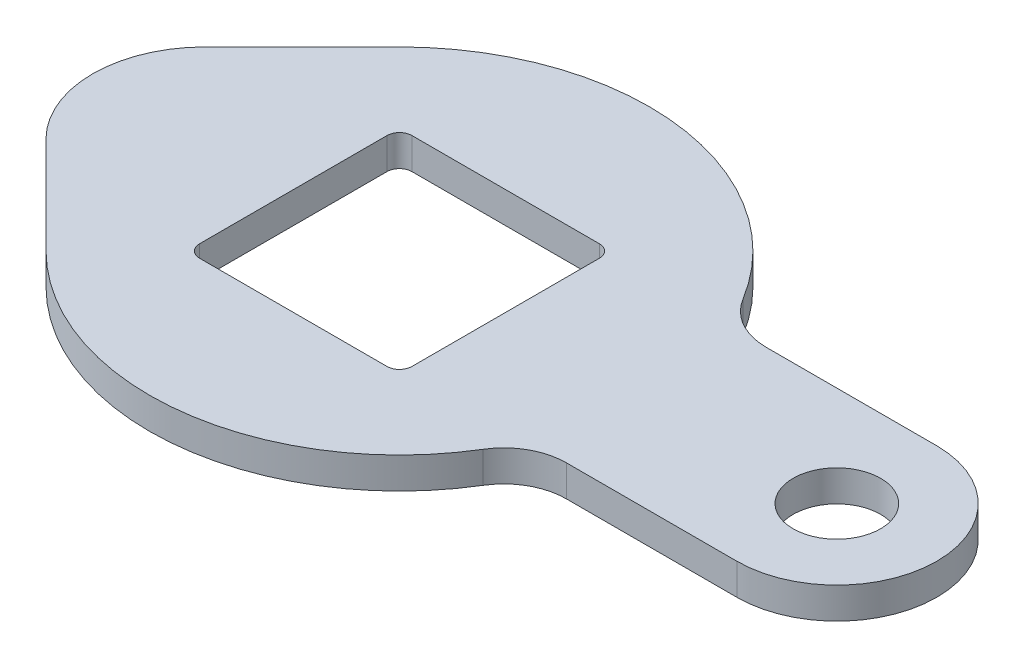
ISO-10303-21;
HEADER;
FILE_DESCRIPTION(('STEP AP214'),'2;1');
FILE_NAME('part.step','',(''),(''),'','','');
FILE_SCHEMA(('AUTOMOTIVE_DESIGN { 1 0 10303 214 1 1 1 1 }'));
ENDSEC;
DATA;
#1=APPLICATION_CONTEXT('core data for automotive mechanical design processes');
#2=APPLICATION_PROTOCOL_DEFINITION('international standard','automotive_design',2000,#1);
#3=PRODUCT_CONTEXT('',#1,'mechanical');
#4=PRODUCT('Part','Part','',(#3));
#5=PRODUCT_RELATED_PRODUCT_CATEGORY('part','',(#4));
#6=PRODUCT_DEFINITION_FORMATION('','',#4);
#7=PRODUCT_DEFINITION_CONTEXT('part definition',#1,'design');
#8=PRODUCT_DEFINITION('design','',#6,#7);
#9=PRODUCT_DEFINITION_SHAPE('','',#8);
#10=(LENGTH_UNIT() NAMED_UNIT(*) SI_UNIT(.MILLI.,.METRE.));
#11=(NAMED_UNIT(*) PLANE_ANGLE_UNIT() SI_UNIT($,.RADIAN.));
#12=(NAMED_UNIT(*) SI_UNIT($,.STERADIAN.) SOLID_ANGLE_UNIT());
#13=UNCERTAINTY_MEASURE_WITH_UNIT(LENGTH_MEASURE(1.E-05),#10,'distance_accuracy_value','');
#14=(GEOMETRIC_REPRESENTATION_CONTEXT(3) GLOBAL_UNCERTAINTY_ASSIGNED_CONTEXT((#13)) GLOBAL_UNIT_ASSIGNED_CONTEXT((#10,
#11,#12)) REPRESENTATION_CONTEXT('',''));
#15=CARTESIAN_POINT('',(0.,0.,0.));
#16=DIRECTION('',(0.,0.,1.));
#17=DIRECTION('',(1.,0.,0.));
#18=AXIS2_PLACEMENT_3D('',#15,#16,#17);
#19=CARTESIAN_POINT('',(21.3541565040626,-2.5,-13.));
#20=DIRECTION('',(0.,1.,0.));
#21=DIRECTION('',(0.,0.,1.));
#22=AXIS2_PLACEMENT_3D('',#19,#20,#21);
#23=CYLINDRICAL_SURFACE('',#22,5.);
#24=CARTESIAN_POINT('',(21.3541565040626,0.,-13.));
#25=DIRECTION('',(0.,-1.,0.));
#26=DIRECTION('',(0.,0.,-1.));
#27=AXIS2_PLACEMENT_3D('',#24,#25,#26);
#28=CIRCLE('',#27,5.);
#29=CARTESIAN_POINT('',(21.3541565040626,0.,-8.));
#30=VERTEX_POINT('',#29);
#31=CARTESIAN_POINT('',(17.0833252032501,0.,-10.4));
#32=VERTEX_POINT('',#31);
#33=EDGE_CURVE('E219',#30,#32,#28,.T.);
#34=ORIENTED_EDGE('',*,*,#33,.F.);
#35=DIRECTION('',(0.,1.,0.));
#36=VECTOR('',#35,1.);
#37=CARTESIAN_POINT('',(21.3541565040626,-2.5,-8.));
#38=LINE('',#37,#36);
#39=CARTESIAN_POINT('',(21.3541565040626,-2.5,-8.));
#40=VERTEX_POINT('',#39);
#41=EDGE_CURVE('E11',#40,#30,#38,.T.);
#42=ORIENTED_EDGE('',*,*,#41,.F.);
#43=CARTESIAN_POINT('',(21.3541565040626,-2.5,-13.));
#44=DIRECTION('',(0.,-1.,0.));
#45=DIRECTION('',(0.,0.,-1.));
#46=AXIS2_PLACEMENT_3D('',#43,#44,#45);
#47=CIRCLE('',#46,5.);
#48=CARTESIAN_POINT('',(17.0833252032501,-2.5,-10.4));
#49=VERTEX_POINT('',#48);
#50=EDGE_CURVE('E231',#40,#49,#47,.T.);
#51=ORIENTED_EDGE('',*,*,#50,.T.);
#52=DIRECTION('',(0.,1.,0.));
#53=VECTOR('',#52,1.);
#54=CARTESIAN_POINT('',(17.0833252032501,-2.5,-10.4));
#55=LINE('',#54,#53);
#56=EDGE_CURVE('E36',#49,#32,#55,.T.);
#57=ORIENTED_EDGE('',*,*,#56,.T.);
#58=EDGE_LOOP('',(#34,#42,#51,#57));
#59=FACE_BOUND('',#58,.T.);
#60=ADVANCED_FACE('F33',(#59),#23,.F.);
#61=CARTESIAN_POINT('',(35.,-2.5,-8.));
#62=DIRECTION('',(0.,0.,-1.));
#63=DIRECTION('',(-1.,0.,0.));
#64=AXIS2_PLACEMENT_3D('',#61,#62,#63);
#65=PLANE('',#64);
#66=DIRECTION('',(-1.,0.,0.));
#67=VECTOR('',#66,1.);
#68=CARTESIAN_POINT('',(35.,0.,-8.));
#69=LINE('',#68,#67);
#70=CARTESIAN_POINT('',(35.,0.,-8.));
#71=VERTEX_POINT('',#70);
#72=EDGE_CURVE('E235',#71,#30,#69,.T.);
#73=ORIENTED_EDGE('',*,*,#72,.F.);
#74=DIRECTION('',(0.,1.,0.));
#75=VECTOR('',#74,1.);
#76=CARTESIAN_POINT('',(35.,-2.5,-8.));
#77=LINE('',#76,#75);
#78=CARTESIAN_POINT('',(35.,-2.5,-8.));
#79=VERTEX_POINT('',#78);
#80=EDGE_CURVE('E41',#79,#71,#77,.T.);
#81=ORIENTED_EDGE('',*,*,#80,.F.);
#82=DIRECTION('',(-1.,0.,0.));
#83=VECTOR('',#82,1.);
#84=CARTESIAN_POINT('',(35.,-2.5,-8.));
#85=LINE('',#84,#83);
#86=EDGE_CURVE('E259',#79,#40,#85,.T.);
#87=ORIENTED_EDGE('',*,*,#86,.T.);
#88=ORIENTED_EDGE('',*,*,#41,.T.);
#89=EDGE_LOOP('',(#73,#81,#87,#88));
#90=FACE_BOUND('',#89,.T.);
#91=ADVANCED_FACE('F316',(#90),#65,.T.);
#92=CARTESIAN_POINT('',(35.,-2.5,0.));
#93=DIRECTION('',(0.,1.,0.));
#94=DIRECTION('',(0.,0.,1.));
#95=AXIS2_PLACEMENT_3D('',#92,#93,#94);
#96=CYLINDRICAL_SURFACE('',#95,8.);
#97=CARTESIAN_POINT('',(35.,0.,0.));
#98=DIRECTION('',(0.,1.,0.));
#99=DIRECTION('',(0.,0.,1.));
#100=AXIS2_PLACEMENT_3D('',#97,#98,#99);
#101=CIRCLE('',#100,8.);
#102=CARTESIAN_POINT('',(35.,0.,8.));
#103=VERTEX_POINT('',#102);
#104=EDGE_CURVE('E285',#103,#71,#101,.T.);
#105=ORIENTED_EDGE('',*,*,#104,.F.);
#106=DIRECTION('',(0.,1.,0.));
#107=VECTOR('',#106,1.);
#108=CARTESIAN_POINT('',(35.,-2.5,8.));
#109=LINE('',#108,#107);
#110=CARTESIAN_POINT('',(35.,-2.5,8.));
#111=VERTEX_POINT('',#110);
#112=EDGE_CURVE('E291',#111,#103,#109,.T.);
#113=ORIENTED_EDGE('',*,*,#112,.F.);
#114=CARTESIAN_POINT('',(35.,-2.5,0.));
#115=DIRECTION('',(0.,1.,0.));
#116=DIRECTION('',(0.,0.,1.));
#117=AXIS2_PLACEMENT_3D('',#114,#115,#116);
#118=CIRCLE('',#117,8.);
#119=EDGE_CURVE('E256',#111,#79,#118,.T.);
#120=ORIENTED_EDGE('',*,*,#119,.T.);
#121=ORIENTED_EDGE('',*,*,#80,.T.);
#122=EDGE_LOOP('',(#105,#113,#120,#121));
#123=FACE_BOUND('',#122,.T.);
#124=ADVANCED_FACE('F343',(#123),#96,.T.);
#125=CARTESIAN_POINT('',(35.,-2.5,8.));
#126=DIRECTION('',(0.,0.,1.));
#127=DIRECTION('',(1.,0.,0.));
#128=AXIS2_PLACEMENT_3D('',#125,#126,#127);
#129=PLANE('',#128);
#130=DIRECTION('',(1.,0.,0.));
#131=VECTOR('',#130,1.);
#132=CARTESIAN_POINT('',(35.,0.,8.));
#133=LINE('',#132,#131);
#134=CARTESIAN_POINT('',(21.3541565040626,0.,8.));
#135=VERTEX_POINT('',#134);
#136=EDGE_CURVE('E282',#135,#103,#133,.T.);
#137=ORIENTED_EDGE('',*,*,#136,.F.);
#138=DIRECTION('',(0.,1.,0.));
#139=VECTOR('',#138,1.);
#140=CARTESIAN_POINT('',(21.3541565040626,-2.5,8.));
#141=LINE('',#140,#139);
#142=CARTESIAN_POINT('',(21.3541565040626,-2.5,8.));
#143=VERTEX_POINT('',#142);
#144=EDGE_CURVE('E293',#143,#135,#141,.T.);
#145=ORIENTED_EDGE('',*,*,#144,.F.);
#146=DIRECTION('',(1.,0.,0.));
#147=VECTOR('',#146,1.);
#148=CARTESIAN_POINT('',(35.,-2.5,8.));
#149=LINE('',#148,#147);
#150=EDGE_CURVE('E253',#143,#111,#149,.T.);
#151=ORIENTED_EDGE('',*,*,#150,.T.);
#152=ORIENTED_EDGE('',*,*,#112,.T.);
#153=EDGE_LOOP('',(#137,#145,#151,#152));
#154=FACE_BOUND('',#153,.T.);
#155=ADVANCED_FACE('F341',(#154),#129,.T.);
#156=CARTESIAN_POINT('',(21.3541565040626,-2.5,13.));
#157=DIRECTION('',(0.,1.,0.));
#158=DIRECTION('',(0.,0.,1.));
#159=AXIS2_PLACEMENT_3D('',#156,#157,#158);
#160=CYLINDRICAL_SURFACE('',#159,5.);
#161=CARTESIAN_POINT('',(21.3541565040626,0.,13.));
#162=DIRECTION('',(0.,-1.,0.));
#163=DIRECTION('',(0.,0.,-1.));
#164=AXIS2_PLACEMENT_3D('',#161,#162,#163);
#165=CIRCLE('',#164,5.);
#166=CARTESIAN_POINT('',(17.0833252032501,0.,10.4));
#167=VERTEX_POINT('',#166);
#168=EDGE_CURVE('E279',#167,#135,#165,.T.);
#169=ORIENTED_EDGE('',*,*,#168,.F.);
#170=DIRECTION('',(0.,1.,0.));
#171=VECTOR('',#170,1.);
#172=CARTESIAN_POINT('',(17.0833252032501,-2.5,10.4));
#173=LINE('',#172,#171);
#174=CARTESIAN_POINT('',(17.0833252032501,-2.5,10.4));
#175=VERTEX_POINT('',#174);
#176=EDGE_CURVE('E295',#175,#167,#173,.T.);
#177=ORIENTED_EDGE('',*,*,#176,.F.);
#178=CARTESIAN_POINT('',(21.3541565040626,-2.5,13.));
#179=DIRECTION('',(0.,-1.,0.));
#180=DIRECTION('',(0.,0.,-1.));
#181=AXIS2_PLACEMENT_3D('',#178,#179,#180);
#182=CIRCLE('',#181,5.);
#183=EDGE_CURVE('E250',#175,#143,#182,.T.);
#184=ORIENTED_EDGE('',*,*,#183,.T.);
#185=ORIENTED_EDGE('',*,*,#144,.T.);
#186=EDGE_LOOP('',(#169,#177,#184,#185));
#187=FACE_BOUND('',#186,.T.);
#188=ADVANCED_FACE('F337',(#187),#160,.F.);
#189=CARTESIAN_POINT('',(0.,-2.5,0.));
#190=DIRECTION('',(0.,1.,0.));
#191=DIRECTION('',(0.,0.,1.));
#192=AXIS2_PLACEMENT_3D('',#189,#190,#191);
#193=CYLINDRICAL_SURFACE('',#192,20.);
#194=CARTESIAN_POINT('',(0.,0.,0.));
#195=DIRECTION('',(0.,1.,0.));
#196=DIRECTION('',(0.,0.,1.));
#197=AXIS2_PLACEMENT_3D('',#194,#195,#196);
#198=CIRCLE('',#197,20.);
#199=CARTESIAN_POINT('',(-14.142135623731,0.,14.1421356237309));
#200=VERTEX_POINT('',#199);
#201=EDGE_CURVE('E276',#200,#167,#198,.T.);
#202=ORIENTED_EDGE('',*,*,#201,.F.);
#203=DIRECTION('',(0.,1.,0.));
#204=VECTOR('',#203,1.);
#205=CARTESIAN_POINT('',(-14.142135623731,-2.5,14.1421356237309));
#206=LINE('',#205,#204);
#207=CARTESIAN_POINT('',(-14.142135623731,-2.5,14.1421356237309));
#208=VERTEX_POINT('',#207);
#209=EDGE_CURVE('E297',#208,#200,#206,.T.);
#210=ORIENTED_EDGE('',*,*,#209,.F.);
#211=CARTESIAN_POINT('',(0.,-2.5,0.));
#212=DIRECTION('',(0.,1.,0.));
#213=DIRECTION('',(0.,0.,1.));
#214=AXIS2_PLACEMENT_3D('',#211,#212,#213);
#215=CIRCLE('',#214,20.);
#216=EDGE_CURVE('E247',#208,#175,#215,.T.);
#217=ORIENTED_EDGE('',*,*,#216,.T.);
#218=ORIENTED_EDGE('',*,*,#176,.T.);
#219=EDGE_LOOP('',(#202,#210,#217,#218));
#220=FACE_BOUND('',#219,.T.);
#221=ADVANCED_FACE('F333',(#220),#193,.T.);
#222=CARTESIAN_POINT('',(-21.920310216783,-2.5,6.36396103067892));
#223=DIRECTION('',(-0.707106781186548,0.,0.707106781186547));
#224=DIRECTION('',(0.707106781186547,0.,0.707106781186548));
#225=AXIS2_PLACEMENT_3D('',#222,#223,#224);
#226=PLANE('',#225);
#227=DIRECTION('',(0.707106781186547,0.,0.707106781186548));
#228=VECTOR('',#227,1.);
#229=CARTESIAN_POINT('',(-21.920310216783,0.,6.36396103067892));
#230=LINE('',#229,#228);
#231=CARTESIAN_POINT('',(-21.920310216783,0.,6.36396103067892));
#232=VERTEX_POINT('',#231);
#233=EDGE_CURVE('E273',#232,#200,#230,.T.);
#234=ORIENTED_EDGE('',*,*,#233,.F.);
#235=DIRECTION('',(0.,1.,0.));
#236=VECTOR('',#235,1.);
#237=CARTESIAN_POINT('',(-21.920310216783,-2.5,6.36396103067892));
#238=LINE('',#237,#236);
#239=CARTESIAN_POINT('',(-21.920310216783,-2.5,6.36396103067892));
#240=VERTEX_POINT('',#239);
#241=EDGE_CURVE('E299',#240,#232,#238,.T.);
#242=ORIENTED_EDGE('',*,*,#241,.F.);
#243=DIRECTION('',(0.707106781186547,0.,0.707106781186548));
#244=VECTOR('',#243,1.);
#245=CARTESIAN_POINT('',(-21.920310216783,-2.5,6.36396103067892));
#246=LINE('',#245,#244);
#247=EDGE_CURVE('E244',#240,#208,#246,.T.);
#248=ORIENTED_EDGE('',*,*,#247,.T.);
#249=ORIENTED_EDGE('',*,*,#209,.T.);
#250=EDGE_LOOP('',(#234,#242,#248,#249));
#251=FACE_BOUND('',#250,.T.);
#252=ADVANCED_FACE('F329',(#251),#226,.T.);
#253=CARTESIAN_POINT('',(-15.556349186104,-2.5,0.));
#254=DIRECTION('',(0.,1.,0.));
#255=DIRECTION('',(0.,0.,1.));
#256=AXIS2_PLACEMENT_3D('',#253,#254,#255);
#257=CYLINDRICAL_SURFACE('',#256,8.99999999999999);
#258=CARTESIAN_POINT('',(-15.556349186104,0.,0.));
#259=DIRECTION('',(0.,1.,0.));
#260=DIRECTION('',(0.,0.,-1.));
#261=AXIS2_PLACEMENT_3D('',#258,#259,#260);
#262=CIRCLE('',#261,8.99999999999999);
#263=CARTESIAN_POINT('',(-21.920310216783,0.,-6.36396103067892));
#264=VERTEX_POINT('',#263);
#265=EDGE_CURVE('E270',#264,#232,#262,.T.);
#266=ORIENTED_EDGE('',*,*,#265,.F.);
#267=DIRECTION('',(0.,1.,0.));
#268=VECTOR('',#267,1.);
#269=CARTESIAN_POINT('',(-21.920310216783,-2.5,-6.36396103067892));
#270=LINE('',#269,#268);
#271=CARTESIAN_POINT('',(-21.920310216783,-2.5,-6.36396103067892));
#272=VERTEX_POINT('',#271);
#273=EDGE_CURVE('E301',#272,#264,#270,.T.);
#274=ORIENTED_EDGE('',*,*,#273,.F.);
#275=CARTESIAN_POINT('',(-15.556349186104,-2.5,0.));
#276=DIRECTION('',(0.,1.,0.));
#277=DIRECTION('',(0.,0.,-1.));
#278=AXIS2_PLACEMENT_3D('',#275,#276,#277);
#279=CIRCLE('',#278,8.99999999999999);
#280=EDGE_CURVE('E241',#272,#240,#279,.T.);
#281=ORIENTED_EDGE('',*,*,#280,.T.);
#282=ORIENTED_EDGE('',*,*,#241,.T.);
#283=EDGE_LOOP('',(#266,#274,#281,#282));
#284=FACE_BOUND('',#283,.T.);
#285=ADVANCED_FACE('F327',(#284),#257,.T.);
#286=CARTESIAN_POINT('',(-14.1421356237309,-2.5,-14.1421356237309));
#287=DIRECTION('',(-0.707106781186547,0.,-0.707106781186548));
#288=DIRECTION('',(-0.707106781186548,0.,0.707106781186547));
#289=AXIS2_PLACEMENT_3D('',#286,#287,#288);
#290=PLANE('',#289);
#291=DIRECTION('',(-0.707106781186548,0.,0.707106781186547));
#292=VECTOR('',#291,1.);
#293=CARTESIAN_POINT('',(-14.1421356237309,0.,-14.1421356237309));
#294=LINE('',#293,#292);
#295=CARTESIAN_POINT('',(-14.1421356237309,0.,-14.1421356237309));
#296=VERTEX_POINT('',#295);
#297=EDGE_CURVE('E267',#296,#264,#294,.T.);
#298=ORIENTED_EDGE('',*,*,#297,.F.);
#299=DIRECTION('',(0.,1.,0.));
#300=VECTOR('',#299,1.);
#301=CARTESIAN_POINT('',(-14.1421356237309,-2.5,-14.1421356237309));
#302=LINE('',#301,#300);
#303=CARTESIAN_POINT('',(-14.1421356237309,-2.5,-14.1421356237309));
#304=VERTEX_POINT('',#303);
#305=EDGE_CURVE('E302',#304,#296,#302,.T.);
#306=ORIENTED_EDGE('',*,*,#305,.F.);
#307=DIRECTION('',(-0.707106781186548,0.,0.707106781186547));
#308=VECTOR('',#307,1.);
#309=CARTESIAN_POINT('',(-14.1421356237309,-2.5,-14.1421356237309));
#310=LINE('',#309,#308);
#311=EDGE_CURVE('E238',#304,#272,#310,.T.);
#312=ORIENTED_EDGE('',*,*,#311,.T.);
#313=ORIENTED_EDGE('',*,*,#273,.T.);
#314=EDGE_LOOP('',(#298,#306,#312,#313));
#315=FACE_BOUND('',#314,.T.);
#316=ADVANCED_FACE('F323',(#315),#290,.T.);
#317=CARTESIAN_POINT('',(0.,-2.5,0.));
#318=DIRECTION('',(0.,1.,0.));
#319=DIRECTION('',(0.,0.,1.));
#320=AXIS2_PLACEMENT_3D('',#317,#318,#319);
#321=CYLINDRICAL_SURFACE('',#320,20.);
#322=CARTESIAN_POINT('',(0.,0.,0.));
#323=DIRECTION('',(0.,1.,0.));
#324=DIRECTION('',(0.,0.,1.));
#325=AXIS2_PLACEMENT_3D('',#322,#323,#324);
#326=CIRCLE('',#325,20.);
#327=EDGE_CURVE('E264',#32,#296,#326,.T.);
#328=ORIENTED_EDGE('',*,*,#327,.F.);
#329=ORIENTED_EDGE('',*,*,#56,.F.);
#330=CARTESIAN_POINT('',(0.,-2.5,0.));
#331=DIRECTION('',(0.,1.,0.));
#332=DIRECTION('',(0.,0.,1.));
#333=AXIS2_PLACEMENT_3D('',#330,#331,#332);
#334=CIRCLE('',#333,20.);
#335=EDGE_CURVE('E234',#49,#304,#334,.T.);
#336=ORIENTED_EDGE('',*,*,#335,.T.);
#337=ORIENTED_EDGE('',*,*,#305,.T.);
#338=EDGE_LOOP('',(#328,#329,#336,#337));
#339=FACE_BOUND('',#338,.T.);
#340=ADVANCED_FACE('F310',(#339),#321,.T.);
#341=CARTESIAN_POINT('',(21.3541565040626,-2.5,-13.));
#342=DIRECTION('',(0.,-1.,0.));
#343=DIRECTION('',(0.,0.,-1.));
#344=AXIS2_PLACEMENT_3D('',#341,#342,#343);
#345=PLANE('',#344);
#346=CARTESIAN_POINT('',(35.,-2.5,0.));
#347=DIRECTION('',(0.,1.,0.));
#348=DIRECTION('',(0.,0.,1.));
#349=AXIS2_PLACEMENT_3D('',#346,#347,#348);
#350=CIRCLE('',#349,3.5);
#351=CARTESIAN_POINT('',(35.,-2.5,3.5));
#352=VERTEX_POINT('',#351);
#353=EDGE_CURVE('E201',#352,#352,#350,.T.);
#354=ORIENTED_EDGE('',*,*,#353,.T.);
#355=EDGE_LOOP('',(#354));
#356=FACE_BOUND('',#355,.T.);
#357=CARTESIAN_POINT('',(-7.5,-2.5,-7.5));
#358=DIRECTION('',(0.,1.,0.));
#359=DIRECTION('',(0.,0.,1.));
#360=AXIS2_PLACEMENT_3D('',#357,#358,#359);
#361=CIRCLE('',#360,0.999999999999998);
#362=CARTESIAN_POINT('',(-7.5,-2.5,-8.5));
#363=VERTEX_POINT('',#362);
#364=CARTESIAN_POINT('',(-8.5,-2.5,-7.5));
#365=VERTEX_POINT('',#364);
#366=EDGE_CURVE('E160',#363,#365,#361,.T.);
#367=ORIENTED_EDGE('',*,*,#366,.T.);
#368=DIRECTION('',(0.,0.,1.));
#369=VECTOR('',#368,1.);
#370=CARTESIAN_POINT('',(-8.5,-2.5,-7.5));
#371=LINE('',#370,#369);
#372=CARTESIAN_POINT('',(-8.5,-2.5,7.5));
#373=VERTEX_POINT('',#372);
#374=EDGE_CURVE('E169',#365,#373,#371,.T.);
#375=ORIENTED_EDGE('',*,*,#374,.T.);
#376=CARTESIAN_POINT('',(-7.5,-2.5,7.5));
#377=DIRECTION('',(0.,1.,0.));
#378=DIRECTION('',(0.,0.,1.));
#379=AXIS2_PLACEMENT_3D('',#376,#377,#378);
#380=CIRCLE('',#379,0.999999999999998);
#381=CARTESIAN_POINT('',(-7.5,-2.5,8.5));
#382=VERTEX_POINT('',#381);
#383=EDGE_CURVE('E49',#373,#382,#380,.T.);
#384=ORIENTED_EDGE('',*,*,#383,.T.);
#385=DIRECTION('',(1.,0.,0.));
#386=VECTOR('',#385,1.);
#387=CARTESIAN_POINT('',(-7.5,-2.5,8.5));
#388=LINE('',#387,#386);
#389=CARTESIAN_POINT('',(7.50000000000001,-2.5,8.49999999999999));
#390=VERTEX_POINT('',#389);
#391=EDGE_CURVE('E187',#382,#390,#388,.T.);
#392=ORIENTED_EDGE('',*,*,#391,.T.);
#393=CARTESIAN_POINT('',(7.50000000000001,-2.5,7.5));
#394=DIRECTION('',(0.,1.,0.));
#395=DIRECTION('',(0.,0.,1.));
#396=AXIS2_PLACEMENT_3D('',#393,#394,#395);
#397=CIRCLE('',#396,0.999999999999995);
#398=CARTESIAN_POINT('',(8.5,-2.5,7.5));
#399=VERTEX_POINT('',#398);
#400=EDGE_CURVE('E190',#390,#399,#397,.T.);
#401=ORIENTED_EDGE('',*,*,#400,.T.);
#402=DIRECTION('',(0.,0.,-1.));
#403=VECTOR('',#402,1.);
#404=CARTESIAN_POINT('',(8.5,-2.5,-7.49999999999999));
#405=LINE('',#404,#403);
#406=CARTESIAN_POINT('',(8.5,-2.5,-7.49999999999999));
#407=VERTEX_POINT('',#406);
#408=EDGE_CURVE('E193',#399,#407,#405,.T.);
#409=ORIENTED_EDGE('',*,*,#408,.T.);
#410=CARTESIAN_POINT('',(7.5,-2.5,-7.5));
#411=DIRECTION('',(0.,1.,0.));
#412=DIRECTION('',(0.,0.,-1.));
#413=AXIS2_PLACEMENT_3D('',#410,#411,#412);
#414=CIRCLE('',#413,1.);
#415=CARTESIAN_POINT('',(7.49999999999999,-2.5,-8.5));
#416=VERTEX_POINT('',#415);
#417=EDGE_CURVE('E196',#407,#416,#414,.T.);
#418=ORIENTED_EDGE('',*,*,#417,.T.);
#419=DIRECTION('',(-1.,0.,0.));
#420=VECTOR('',#419,1.);
#421=CARTESIAN_POINT('',(-7.5,-2.5,-8.5));
#422=LINE('',#421,#420);
#423=EDGE_CURVE('E166',#416,#363,#422,.T.);
#424=ORIENTED_EDGE('',*,*,#423,.T.);
#425=EDGE_LOOP('',(#367,#375,#384,#392,#401,#409,#418,#424));
#426=FACE_BOUND('',#425,.T.);
#427=ORIENTED_EDGE('',*,*,#50,.F.);
#428=ORIENTED_EDGE('',*,*,#86,.F.);
#429=ORIENTED_EDGE('',*,*,#119,.F.);
#430=ORIENTED_EDGE('',*,*,#150,.F.);
#431=ORIENTED_EDGE('',*,*,#183,.F.);
#432=ORIENTED_EDGE('',*,*,#216,.F.);
#433=ORIENTED_EDGE('',*,*,#247,.F.);
#434=ORIENTED_EDGE('',*,*,#280,.F.);
#435=ORIENTED_EDGE('',*,*,#311,.F.);
#436=ORIENTED_EDGE('',*,*,#335,.F.);
#437=EDGE_LOOP('',(#427,#428,#429,#430,#431,#432,#433,#434,#435,#436));
#438=FACE_BOUND('',#437,.T.);
#439=ADVANCED_FACE('F173',(#356,#426,#438),#345,.T.);
#440=CARTESIAN_POINT('',(21.3541565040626,0.,-13.));
#441=DIRECTION('',(0.,-1.,0.));
#442=DIRECTION('',(0.,0.,-1.));
#443=AXIS2_PLACEMENT_3D('',#440,#441,#442);
#444=PLANE('',#443);
#445=CARTESIAN_POINT('',(35.,0.,0.));
#446=DIRECTION('',(0.,1.,0.));
#447=DIRECTION('',(0.,0.,1.));
#448=AXIS2_PLACEMENT_3D('',#445,#446,#447);
#449=CIRCLE('',#448,3.5);
#450=CARTESIAN_POINT('',(35.,0.,3.5));
#451=VERTEX_POINT('',#450);
#452=EDGE_CURVE('E183',#451,#451,#449,.T.);
#453=ORIENTED_EDGE('',*,*,#452,.F.);
#454=EDGE_LOOP('',(#453));
#455=FACE_BOUND('',#454,.T.);
#456=DIRECTION('',(0.,0.,1.));
#457=VECTOR('',#456,1.);
#458=CARTESIAN_POINT('',(-8.5,0.,-7.5));
#459=LINE('',#458,#457);
#460=CARTESIAN_POINT('',(-8.5,0.,-7.5));
#461=VERTEX_POINT('',#460);
#462=CARTESIAN_POINT('',(-8.5,0.,7.5));
#463=VERTEX_POINT('',#462);
#464=EDGE_CURVE('E200',#461,#463,#459,.T.);
#465=ORIENTED_EDGE('',*,*,#464,.F.);
#466=CARTESIAN_POINT('',(-7.5,0.,-7.5));
#467=DIRECTION('',(0.,1.,0.));
#468=DIRECTION('',(0.,0.,1.));
#469=AXIS2_PLACEMENT_3D('',#466,#467,#468);
#470=CIRCLE('',#469,0.999999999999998);
#471=CARTESIAN_POINT('',(-7.5,0.,-8.5));
#472=VERTEX_POINT('',#471);
#473=EDGE_CURVE('E57',#472,#461,#470,.T.);
#474=ORIENTED_EDGE('',*,*,#473,.F.);
#475=DIRECTION('',(-1.,0.,0.));
#476=VECTOR('',#475,1.);
#477=CARTESIAN_POINT('',(-7.5,0.,-8.5));
#478=LINE('',#477,#476);
#479=CARTESIAN_POINT('',(7.49999999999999,0.,-8.5));
#480=VERTEX_POINT('',#479);
#481=EDGE_CURVE('E177',#480,#472,#478,.T.);
#482=ORIENTED_EDGE('',*,*,#481,.F.);
#483=CARTESIAN_POINT('',(7.5,0.,-7.5));
#484=DIRECTION('',(0.,1.,0.));
#485=DIRECTION('',(0.,0.,-1.));
#486=AXIS2_PLACEMENT_3D('',#483,#484,#485);
#487=CIRCLE('',#486,1.);
#488=CARTESIAN_POINT('',(8.5,0.,-7.49999999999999));
#489=VERTEX_POINT('',#488);
#490=EDGE_CURVE('E180',#489,#480,#487,.T.);
#491=ORIENTED_EDGE('',*,*,#490,.F.);
#492=DIRECTION('',(0.,0.,-1.));
#493=VECTOR('',#492,1.);
#494=CARTESIAN_POINT('',(8.5,0.,-7.49999999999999));
#495=LINE('',#494,#493);
#496=CARTESIAN_POINT('',(8.5,0.,7.5));
#497=VERTEX_POINT('',#496);
#498=EDGE_CURVE('E212',#497,#489,#495,.T.);
#499=ORIENTED_EDGE('',*,*,#498,.F.);
#500=CARTESIAN_POINT('',(7.50000000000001,0.,7.5));
#501=DIRECTION('',(0.,1.,0.));
#502=DIRECTION('',(0.,0.,1.));
#503=AXIS2_PLACEMENT_3D('',#500,#501,#502);
#504=CIRCLE('',#503,0.999999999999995);
#505=CARTESIAN_POINT('',(7.50000000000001,0.,8.49999999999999));
#506=VERTEX_POINT('',#505);
#507=EDGE_CURVE('E209',#506,#497,#504,.T.);
#508=ORIENTED_EDGE('',*,*,#507,.F.);
#509=DIRECTION('',(1.,0.,0.));
#510=VECTOR('',#509,1.);
#511=CARTESIAN_POINT('',(-7.5,0.,8.5));
#512=LINE('',#511,#510);
#513=CARTESIAN_POINT('',(-7.5,0.,8.5));
#514=VERTEX_POINT('',#513);
#515=EDGE_CURVE('E206',#514,#506,#512,.T.);
#516=ORIENTED_EDGE('',*,*,#515,.F.);
#517=CARTESIAN_POINT('',(-7.5,0.,7.5));
#518=DIRECTION('',(0.,1.,0.));
#519=DIRECTION('',(0.,0.,1.));
#520=AXIS2_PLACEMENT_3D('',#517,#518,#519);
#521=CIRCLE('',#520,0.999999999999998);
#522=EDGE_CURVE('E203',#463,#514,#521,.T.);
#523=ORIENTED_EDGE('',*,*,#522,.F.);
#524=EDGE_LOOP('',(#465,#474,#482,#491,#499,#508,#516,#523));
#525=FACE_BOUND('',#524,.T.);
#526=ORIENTED_EDGE('',*,*,#33,.T.);
#527=ORIENTED_EDGE('',*,*,#327,.T.);
#528=ORIENTED_EDGE('',*,*,#297,.T.);
#529=ORIENTED_EDGE('',*,*,#265,.T.);
#530=ORIENTED_EDGE('',*,*,#233,.T.);
#531=ORIENTED_EDGE('',*,*,#201,.T.);
#532=ORIENTED_EDGE('',*,*,#168,.T.);
#533=ORIENTED_EDGE('',*,*,#136,.T.);
#534=ORIENTED_EDGE('',*,*,#104,.T.);
#535=ORIENTED_EDGE('',*,*,#72,.T.);
#536=EDGE_LOOP('',(#526,#527,#528,#529,#530,#531,#532,#533,#534,#535));
#537=FACE_BOUND('',#536,.T.);
#538=ADVANCED_FACE('F312',(#455,#525,#537),#444,.F.);
#539=CARTESIAN_POINT('',(-7.5,-2.5,-7.5));
#540=DIRECTION('',(0.,1.,0.));
#541=DIRECTION('',(0.,0.,1.));
#542=AXIS2_PLACEMENT_3D('',#539,#540,#541);
#543=CYLINDRICAL_SURFACE('',#542,0.999999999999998);
#544=ORIENTED_EDGE('',*,*,#473,.T.);
#545=DIRECTION('',(0.,1.,0.));
#546=VECTOR('',#545,1.);
#547=CARTESIAN_POINT('',(-8.5,-2.5,-7.5));
#548=LINE('',#547,#546);
#549=EDGE_CURVE('E156',#365,#461,#548,.T.);
#550=ORIENTED_EDGE('',*,*,#549,.F.);
#551=ORIENTED_EDGE('',*,*,#366,.F.);
#552=DIRECTION('',(0.,1.,0.));
#553=VECTOR('',#552,1.);
#554=CARTESIAN_POINT('',(-7.5,-2.5,-8.5));
#555=LINE('',#554,#553);
#556=EDGE_CURVE('E217',#363,#472,#555,.T.);
#557=ORIENTED_EDGE('',*,*,#556,.T.);
#558=EDGE_LOOP('',(#544,#550,#551,#557));
#559=FACE_BOUND('',#558,.T.);
#560=ADVANCED_FACE('F158',(#559),#543,.F.);
#561=CARTESIAN_POINT('',(-7.5,-2.5,-8.5));
#562=DIRECTION('',(0.,0.,-1.));
#563=DIRECTION('',(-1.,0.,0.));
#564=AXIS2_PLACEMENT_3D('',#561,#562,#563);
#565=PLANE('',#564);
#566=ORIENTED_EDGE('',*,*,#481,.T.);
#567=ORIENTED_EDGE('',*,*,#556,.F.);
#568=ORIENTED_EDGE('',*,*,#423,.F.);
#569=DIRECTION('',(0.,1.,0.));
#570=VECTOR('',#569,1.);
#571=CARTESIAN_POINT('',(7.49999999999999,-2.5,-8.5));
#572=LINE('',#571,#570);
#573=EDGE_CURVE('E220',#416,#480,#572,.T.);
#574=ORIENTED_EDGE('',*,*,#573,.T.);
#575=EDGE_LOOP('',(#566,#567,#568,#574));
#576=FACE_BOUND('',#575,.T.);
#577=ADVANCED_FACE('F443',(#576),#565,.F.);
#578=CARTESIAN_POINT('',(7.5,-2.5,-7.5));
#579=DIRECTION('',(0.,1.,0.));
#580=DIRECTION('',(0.,0.,1.));
#581=AXIS2_PLACEMENT_3D('',#578,#579,#580);
#582=CYLINDRICAL_SURFACE('',#581,1.);
#583=ORIENTED_EDGE('',*,*,#490,.T.);
#584=ORIENTED_EDGE('',*,*,#573,.F.);
#585=ORIENTED_EDGE('',*,*,#417,.F.);
#586=DIRECTION('',(0.,1.,0.));
#587=VECTOR('',#586,1.);
#588=CARTESIAN_POINT('',(8.5,-2.5,-7.49999999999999));
#589=LINE('',#588,#587);
#590=EDGE_CURVE('E222',#407,#489,#589,.T.);
#591=ORIENTED_EDGE('',*,*,#590,.T.);
#592=EDGE_LOOP('',(#583,#584,#585,#591));
#593=FACE_BOUND('',#592,.T.);
#594=ADVANCED_FACE('F452',(#593),#582,.F.);
#595=CARTESIAN_POINT('',(8.5,-2.5,-7.49999999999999));
#596=DIRECTION('',(1.,0.,0.));
#597=DIRECTION('',(0.,0.,-1.));
#598=AXIS2_PLACEMENT_3D('',#595,#596,#597);
#599=PLANE('',#598);
#600=ORIENTED_EDGE('',*,*,#498,.T.);
#601=ORIENTED_EDGE('',*,*,#590,.F.);
#602=ORIENTED_EDGE('',*,*,#408,.F.);
#603=DIRECTION('',(0.,1.,0.));
#604=VECTOR('',#603,1.);
#605=CARTESIAN_POINT('',(8.5,-2.5,7.5));
#606=LINE('',#605,#604);
#607=EDGE_CURVE('E224',#399,#497,#606,.T.);
#608=ORIENTED_EDGE('',*,*,#607,.T.);
#609=EDGE_LOOP('',(#600,#601,#602,#608));
#610=FACE_BOUND('',#609,.T.);
#611=ADVANCED_FACE('F462',(#610),#599,.F.);
#612=CARTESIAN_POINT('',(7.50000000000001,-2.5,7.5));
#613=DIRECTION('',(0.,1.,0.));
#614=DIRECTION('',(0.,0.,1.));
#615=AXIS2_PLACEMENT_3D('',#612,#613,#614);
#616=CYLINDRICAL_SURFACE('',#615,0.999999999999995);
#617=ORIENTED_EDGE('',*,*,#507,.T.);
#618=ORIENTED_EDGE('',*,*,#607,.F.);
#619=ORIENTED_EDGE('',*,*,#400,.F.);
#620=DIRECTION('',(0.,1.,0.));
#621=VECTOR('',#620,1.);
#622=CARTESIAN_POINT('',(7.50000000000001,-2.5,8.49999999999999));
#623=LINE('',#622,#621);
#624=EDGE_CURVE('E226',#390,#506,#623,.T.);
#625=ORIENTED_EDGE('',*,*,#624,.T.);
#626=EDGE_LOOP('',(#617,#618,#619,#625));
#627=FACE_BOUND('',#626,.T.);
#628=ADVANCED_FACE('F472',(#627),#616,.F.);
#629=CARTESIAN_POINT('',(-7.5,-2.5,8.5));
#630=DIRECTION('',(0.,0.,1.));
#631=DIRECTION('',(1.,0.,0.));
#632=AXIS2_PLACEMENT_3D('',#629,#630,#631);
#633=PLANE('',#632);
#634=ORIENTED_EDGE('',*,*,#515,.T.);
#635=ORIENTED_EDGE('',*,*,#624,.F.);
#636=ORIENTED_EDGE('',*,*,#391,.F.);
#637=DIRECTION('',(0.,1.,0.));
#638=VECTOR('',#637,1.);
#639=CARTESIAN_POINT('',(-7.5,-2.5,8.5));
#640=LINE('',#639,#638);
#641=EDGE_CURVE('E228',#382,#514,#640,.T.);
#642=ORIENTED_EDGE('',*,*,#641,.T.);
#643=EDGE_LOOP('',(#634,#635,#636,#642));
#644=FACE_BOUND('',#643,.T.);
#645=ADVANCED_FACE('F482',(#644),#633,.F.);
#646=CARTESIAN_POINT('',(-7.5,-2.5,7.5));
#647=DIRECTION('',(0.,1.,0.));
#648=DIRECTION('',(0.,0.,1.));
#649=AXIS2_PLACEMENT_3D('',#646,#647,#648);
#650=CYLINDRICAL_SURFACE('',#649,0.999999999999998);
#651=ORIENTED_EDGE('',*,*,#522,.T.);
#652=ORIENTED_EDGE('',*,*,#641,.F.);
#653=ORIENTED_EDGE('',*,*,#383,.F.);
#654=DIRECTION('',(0.,1.,0.));
#655=VECTOR('',#654,1.);
#656=CARTESIAN_POINT('',(-8.5,-2.5,7.5));
#657=LINE('',#656,#655);
#658=EDGE_CURVE('E165',#373,#463,#657,.T.);
#659=ORIENTED_EDGE('',*,*,#658,.T.);
#660=EDGE_LOOP('',(#651,#652,#653,#659));
#661=FACE_BOUND('',#660,.T.);
#662=ADVANCED_FACE('F492',(#661),#650,.F.);
#663=CARTESIAN_POINT('',(-8.5,-2.5,-7.5));
#664=DIRECTION('',(-1.,0.,0.));
#665=DIRECTION('',(0.,0.,1.));
#666=AXIS2_PLACEMENT_3D('',#663,#664,#665);
#667=PLANE('',#666);
#668=ORIENTED_EDGE('',*,*,#464,.T.);
#669=ORIENTED_EDGE('',*,*,#658,.F.);
#670=ORIENTED_EDGE('',*,*,#374,.F.);
#671=ORIENTED_EDGE('',*,*,#549,.T.);
#672=EDGE_LOOP('',(#668,#669,#670,#671));
#673=FACE_BOUND('',#672,.T.);
#674=ADVANCED_FACE('F170',(#673),#667,.F.);
#675=CARTESIAN_POINT('',(35.,-2.5,0.));
#676=DIRECTION('',(0.,1.,0.));
#677=DIRECTION('',(0.,0.,1.));
#678=AXIS2_PLACEMENT_3D('',#675,#676,#677);
#679=CYLINDRICAL_SURFACE('',#678,3.5);
#680=ORIENTED_EDGE('',*,*,#353,.F.);
#681=EDGE_LOOP('',(#680));
#682=FACE_BOUND('',#681,.T.);
#683=ORIENTED_EDGE('',*,*,#452,.T.);
#684=EDGE_LOOP('',(#683));
#685=FACE_BOUND('',#684,.T.);
#686=ADVANCED_FACE('F510',(#682,#685),#679,.F.);
#687=CLOSED_SHELL('',(#60,#91,#124,#155,#188,#221,#252,#285,#316,#340,#439,#538,#560,#577,#594,
#611,#628,#645,#662,#674,#686));
#688=MANIFOLD_SOLID_BREP('B2',#687);
#689=ADVANCED_BREP_SHAPE_REPRESENTATION('',(#18,#688),#14);
#690=SHAPE_DEFINITION_REPRESENTATION(#9,#689);
ENDSEC;
END-ISO-10303-21;
